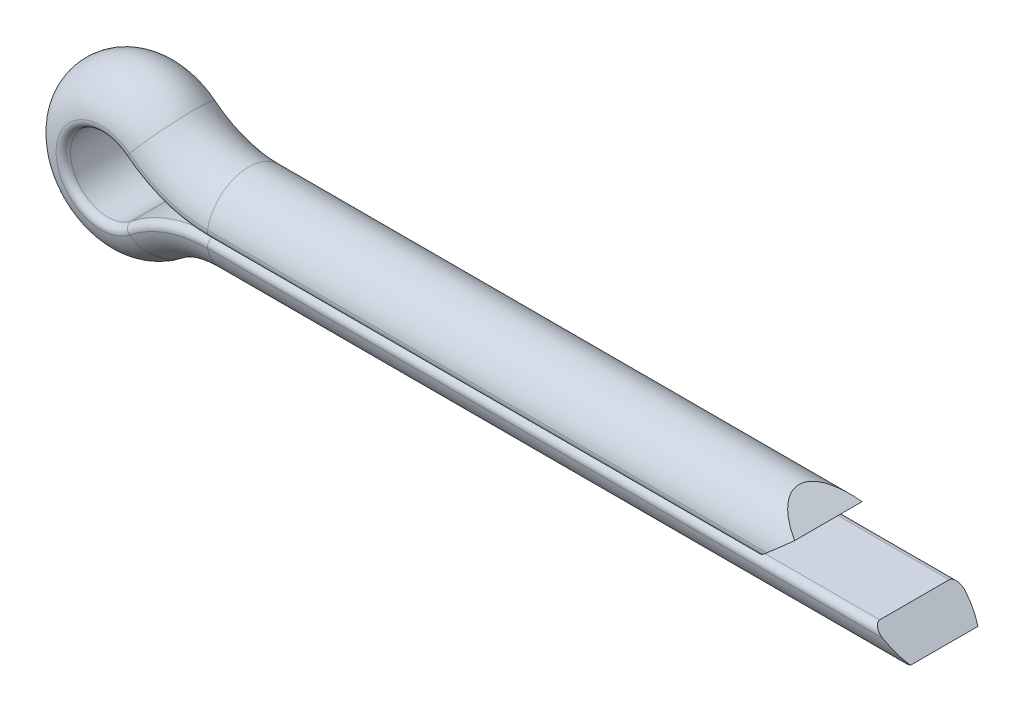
ISO-10303-21;
HEADER;
FILE_DESCRIPTION(('STEP AP214'),'2;1');
FILE_NAME('part.step','',(''),(''),'','','');
FILE_SCHEMA(('AUTOMOTIVE_DESIGN { 1 0 10303 214 1 1 1 1 }'));
ENDSEC;
DATA;
#1=APPLICATION_CONTEXT('core data for automotive mechanical design processes');
#2=APPLICATION_PROTOCOL_DEFINITION('international standard','automotive_design',2000,#1);
#3=PRODUCT_CONTEXT('',#1,'mechanical');
#4=PRODUCT('Part','Part','',(#3));
#5=PRODUCT_RELATED_PRODUCT_CATEGORY('part','',(#4));
#6=PRODUCT_DEFINITION_FORMATION('','',#4);
#7=PRODUCT_DEFINITION_CONTEXT('part definition',#1,'design');
#8=PRODUCT_DEFINITION('design','',#6,#7);
#9=PRODUCT_DEFINITION_SHAPE('','',#8);
#10=(LENGTH_UNIT() NAMED_UNIT(*) SI_UNIT(.MILLI.,.METRE.));
#11=(NAMED_UNIT(*) PLANE_ANGLE_UNIT() SI_UNIT($,.RADIAN.));
#12=(NAMED_UNIT(*) SI_UNIT($,.STERADIAN.) SOLID_ANGLE_UNIT());
#13=UNCERTAINTY_MEASURE_WITH_UNIT(LENGTH_MEASURE(1.E-05),#10,'distance_accuracy_value','');
#14=(GEOMETRIC_REPRESENTATION_CONTEXT(3) GLOBAL_UNCERTAINTY_ASSIGNED_CONTEXT((#13)) GLOBAL_UNIT_ASSIGNED_CONTEXT((#10,
#11,#12)) REPRESENTATION_CONTEXT('',''));
#15=CARTESIAN_POINT('',(0.,0.,0.));
#16=DIRECTION('',(0.,0.,1.));
#17=DIRECTION('',(1.,0.,0.));
#18=AXIS2_PLACEMENT_3D('',#15,#16,#17);
#19=CARTESIAN_POINT('',(3.66500000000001,0.,0.));
#20=DIRECTION('',(1.,0.,0.));
#21=DIRECTION('',(0.,0.,-1.));
#22=AXIS2_PLACEMENT_3D('',#19,#20,#21);
#23=CYLINDRICAL_SURFACE('',#22,1.45);
#24=CARTESIAN_POINT('',(29.1549658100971,0.,0.));
#25=DIRECTION('',(-0.501148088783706,0.865361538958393,0.));
#26=DIRECTION('',(0.865361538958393,0.501148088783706,0.));
#27=AXIS2_PLACEMENT_3D('',#24,#25,#26);
#28=ELLIPSE('',#27,2.89335634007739,1.45);
#29=CARTESIAN_POINT('',(27.665,-0.862868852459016,-1.16531426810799));
#30=VERTEX_POINT('',#29);
#31=CARTESIAN_POINT('',(27.665,-0.862868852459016,1.16531426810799));
#32=VERTEX_POINT('',#31);
#33=EDGE_CURVE('E166',#30,#32,#28,.T.);
#34=ORIENTED_EDGE('',*,*,#33,.T.);
#35=CARTESIAN_POINT('',(26.6338989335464,0.,0.));
#36=DIRECTION('',(-0.641771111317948,-0.766896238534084,0.));
#37=DIRECTION('',(0.766896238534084,-0.641771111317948,0.));
#38=AXIS2_PLACEMENT_3D('',#35,#36,#37);
#39=ELLIPSE('',#38,2.25937249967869,1.45);
#40=CARTESIAN_POINT('',(26.9633967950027,-0.275737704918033,1.42354090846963));
#41=VERTEX_POINT('',#40);
#42=EDGE_CURVE('E165',#32,#41,#39,.T.);
#43=ORIENTED_EDGE('',*,*,#42,.T.);
#44=DIRECTION('',(1.,0.,0.));
#45=VECTOR('',#44,1.);
#46=CARTESIAN_POINT('',(3.66500000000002,-0.275737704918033,1.42354090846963));
#47=LINE('',#46,#45);
#48=CARTESIAN_POINT('',(3.66500000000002,-0.275737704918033,1.42354090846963));
#49=VERTEX_POINT('',#48);
#50=EDGE_CURVE('E11',#49,#41,#47,.T.);
#51=ORIENTED_EDGE('',*,*,#50,.F.);
#52=CARTESIAN_POINT('',(3.66500000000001,0.,0.));
#53=DIRECTION('',(-1.,0.,0.));
#54=DIRECTION('',(0.,0.,-1.));
#55=AXIS2_PLACEMENT_3D('',#52,#53,#54);
#56=CIRCLE('',#55,1.45);
#57=CARTESIAN_POINT('',(3.66500000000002,-0.275737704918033,-1.42354090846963));
#58=VERTEX_POINT('',#57);
#59=EDGE_CURVE('E248',#58,#49,#56,.T.);
#60=ORIENTED_EDGE('',*,*,#59,.F.);
#61=DIRECTION('',(1.,0.,0.));
#62=VECTOR('',#61,1.);
#63=CARTESIAN_POINT('',(3.66500000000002,-0.275737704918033,-1.42354090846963));
#64=LINE('',#63,#62);
#65=CARTESIAN_POINT('',(26.9633967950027,-0.275737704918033,-1.42354090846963));
#66=VERTEX_POINT('',#65);
#67=EDGE_CURVE('E40',#58,#66,#64,.T.);
#68=ORIENTED_EDGE('',*,*,#67,.T.);
#69=EDGE_CURVE('E162',#66,#30,#39,.T.);
#70=ORIENTED_EDGE('',*,*,#69,.T.);
#71=EDGE_LOOP('',(#34,#43,#51,#60,#68,#70));
#72=FACE_BOUND('',#71,.T.);
#73=ADVANCED_FACE('F33',(#72),#23,.T.);
#74=CARTESIAN_POINT('',(3.66500000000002,-0.232000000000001,-1.19773786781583));
#75=DIRECTION('',(1.,0.,0.));
#76=DIRECTION('',(0.,0.,-1.));
#77=AXIS2_PLACEMENT_3D('',#74,#75,#76);
#78=CYLINDRICAL_SURFACE('',#77,0.23);
#79=CARTESIAN_POINT('',(26.9111316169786,-0.232000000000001,-1.19773786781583));
#80=DIRECTION('',(-0.641771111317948,-0.766896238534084,0.));
#81=DIRECTION('',(0.766896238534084,-0.641771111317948,0.));
#82=AXIS2_PLACEMENT_3D('',#79,#80,#81);
#83=ELLIPSE('',#82,0.358383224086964,0.23);
#84=CARTESIAN_POINT('',(26.6362888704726,-0.00200000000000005,-1.19773786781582));
#85=VERTEX_POINT('',#84);
#86=EDGE_CURVE('E160',#85,#66,#83,.T.);
#87=ORIENTED_EDGE('',*,*,#86,.T.);
#88=ORIENTED_EDGE('',*,*,#67,.F.);
#89=CARTESIAN_POINT('',(3.66500000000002,-0.232000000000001,-1.19773786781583));
#90=DIRECTION('',(-1.,0.,0.));
#91=DIRECTION('',(0.,0.,1.));
#92=AXIS2_PLACEMENT_3D('',#89,#90,#91);
#93=CIRCLE('',#92,0.23);
#94=CARTESIAN_POINT('',(3.66500000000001,-0.00200000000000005,-1.19773786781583));
#95=VERTEX_POINT('',#94);
#96=EDGE_CURVE('E245',#95,#58,#93,.T.);
#97=ORIENTED_EDGE('',*,*,#96,.F.);
#98=DIRECTION('',(1.,0.,0.));
#99=VECTOR('',#98,1.);
#100=CARTESIAN_POINT('',(3.66500000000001,-0.00200000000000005,-1.19773786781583));
#101=LINE('',#100,#99);
#102=EDGE_CURVE('E266',#95,#85,#101,.T.);
#103=ORIENTED_EDGE('',*,*,#102,.T.);
#104=EDGE_LOOP('',(#87,#88,#97,#103));
#105=FACE_BOUND('',#104,.T.);
#106=ADVANCED_FACE('F272',(#105),#78,.T.);
#107=CARTESIAN_POINT('',(3.66500000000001,-0.00200000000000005,1.19773786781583));
#108=DIRECTION('',(0.,-1.,0.));
#109=DIRECTION('',(0.,0.,-1.));
#110=AXIS2_PLACEMENT_3D('',#107,#108,#109);
#111=PLANE('',#110);
#112=DIRECTION('',(1.,0.,0.));
#113=VECTOR('',#112,1.);
#114=CARTESIAN_POINT('',(3.66500000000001,-0.00200000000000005,1.19773786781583));
#115=LINE('',#114,#113);
#116=CARTESIAN_POINT('',(3.66500000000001,-0.00200000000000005,1.19773786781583));
#117=VERTEX_POINT('',#116);
#118=CARTESIAN_POINT('',(26.6362888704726,-0.00200000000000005,1.19773786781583));
#119=VERTEX_POINT('',#118);
#120=EDGE_CURVE('E263',#117,#119,#115,.T.);
#121=ORIENTED_EDGE('',*,*,#120,.T.);
#122=DIRECTION('',(0.,0.,-1.));
#123=VECTOR('',#122,1.);
#124=CARTESIAN_POINT('',(26.6362888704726,-0.00200000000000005,1.19773786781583));
#125=LINE('',#124,#123);
#126=EDGE_CURVE('E154',#119,#85,#125,.T.);
#127=ORIENTED_EDGE('',*,*,#126,.T.);
#128=ORIENTED_EDGE('',*,*,#102,.F.);
#129=DIRECTION('',(0.,0.,-1.));
#130=VECTOR('',#129,1.);
#131=CARTESIAN_POINT('',(3.66500000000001,-0.00200000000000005,1.19773786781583));
#132=LINE('',#131,#130);
#133=EDGE_CURVE('E242',#117,#95,#132,.T.);
#134=ORIENTED_EDGE('',*,*,#133,.F.);
#135=EDGE_LOOP('',(#121,#127,#128,#134));
#136=FACE_BOUND('',#135,.T.);
#137=ADVANCED_FACE('F332',(#136),#111,.F.);
#138=CARTESIAN_POINT('',(3.66500000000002,-0.232000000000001,1.19773786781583));
#139=DIRECTION('',(1.,0.,0.));
#140=DIRECTION('',(0.,0.,-1.));
#141=AXIS2_PLACEMENT_3D('',#138,#139,#140);
#142=CYLINDRICAL_SURFACE('',#141,0.23);
#143=CARTESIAN_POINT('',(26.9111316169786,-0.232000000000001,1.19773786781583));
#144=DIRECTION('',(-0.641771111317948,-0.766896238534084,0.));
#145=DIRECTION('',(0.766896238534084,-0.641771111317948,0.));
#146=AXIS2_PLACEMENT_3D('',#143,#144,#145);
#147=ELLIPSE('',#146,0.358383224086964,0.23);
#148=EDGE_CURVE('E152',#41,#119,#147,.T.);
#149=ORIENTED_EDGE('',*,*,#148,.T.);
#150=ORIENTED_EDGE('',*,*,#120,.F.);
#151=CARTESIAN_POINT('',(3.66500000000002,-0.232000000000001,1.19773786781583));
#152=DIRECTION('',(-1.,0.,0.));
#153=DIRECTION('',(0.,0.,1.));
#154=AXIS2_PLACEMENT_3D('',#151,#152,#153);
#155=CIRCLE('',#154,0.23);
#156=EDGE_CURVE('E239',#49,#117,#155,.T.);
#157=ORIENTED_EDGE('',*,*,#156,.F.);
#158=ORIENTED_EDGE('',*,*,#50,.T.);
#159=EDGE_LOOP('',(#149,#150,#157,#158));
#160=FACE_BOUND('',#159,.T.);
#161=ADVANCED_FACE('F329',(#160),#142,.T.);
#162=CARTESIAN_POINT('',(3.665,-4.58404669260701,0.));
#163=DIRECTION('',(0.,0.,-1.));
#164=DIRECTION('',(-1.,0.,0.));
#165=AXIS2_PLACEMENT_3D('',#162,#163,#164);
#166=TOROIDAL_SURFACE('',#165,4.58404669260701,1.45);
#167=CARTESIAN_POINT('',(0.802434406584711,-1.00365533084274,0.));
#168=DIRECTION('',(-0.781054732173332,-0.624462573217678,0.));
#169=DIRECTION('',(0.,0.,-1.));
#170=AXIS2_PLACEMENT_3D('',#167,#168,#169);
#171=CIRCLE('',#170,1.45);
#172=CARTESIAN_POINT('',(0.974622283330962,-1.21902157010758,-1.42354090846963));
#173=VERTEX_POINT('',#172);
#174=CARTESIAN_POINT('',(0.974622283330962,-1.21902157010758,1.42354090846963));
#175=VERTEX_POINT('',#174);
#176=EDGE_CURVE('E224',#173,#175,#171,.T.);
#177=ORIENTED_EDGE('',*,*,#176,.F.);
#178=CARTESIAN_POINT('',(3.665,-4.58404669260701,-1.42354090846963));
#179=DIRECTION('',(0.,0.,-1.));
#180=DIRECTION('',(-1.,0.,0.));
#181=AXIS2_PLACEMENT_3D('',#178,#179,#180);
#182=CIRCLE('',#181,4.30830898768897);
#183=EDGE_CURVE('E257',#173,#58,#182,.T.);
#184=ORIENTED_EDGE('',*,*,#183,.T.);
#185=ORIENTED_EDGE('',*,*,#59,.T.);
#186=CARTESIAN_POINT('',(3.665,-4.58404669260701,1.42354090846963));
#187=DIRECTION('',(0.,0.,-1.));
#188=DIRECTION('',(-1.,0.,0.));
#189=AXIS2_PLACEMENT_3D('',#186,#187,#188);
#190=CIRCLE('',#189,4.30830898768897);
#191=EDGE_CURVE('E260',#175,#49,#190,.T.);
#192=ORIENTED_EDGE('',*,*,#191,.F.);
#193=EDGE_LOOP('',(#177,#184,#185,#192));
#194=FACE_BOUND('',#193,.T.);
#195=ADVANCED_FACE('F314',(#194),#166,.T.);
#196=CARTESIAN_POINT('',(3.665,-4.58404669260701,-1.19773786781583));
#197=DIRECTION('',(0.,0.,-1.));
#198=DIRECTION('',(-1.,0.,0.));
#199=AXIS2_PLACEMENT_3D('',#196,#197,#198);
#200=TOROIDAL_SURFACE('',#199,4.35204669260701,0.23);
#201=CARTESIAN_POINT('',(0.947309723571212,-1.18486002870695,-1.19773786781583));
#202=DIRECTION('',(-0.781054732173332,-0.624462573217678,0.));
#203=DIRECTION('',(0.,0.,1.));
#204=AXIS2_PLACEMENT_3D('',#201,#202,#203);
#205=CIRCLE('',#204,0.23);
#206=CARTESIAN_POINT('',(0.803683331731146,-1.00521744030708,-1.19773786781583));
#207=VERTEX_POINT('',#206);
#208=EDGE_CURVE('E221',#207,#173,#205,.T.);
#209=ORIENTED_EDGE('',*,*,#208,.F.);
#210=CARTESIAN_POINT('',(3.665,-4.58404669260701,-1.19773786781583));
#211=DIRECTION('',(0.,0.,-1.));
#212=DIRECTION('',(-1.,0.,0.));
#213=AXIS2_PLACEMENT_3D('',#210,#211,#212);
#214=CIRCLE('',#213,4.58204669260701);
#215=EDGE_CURVE('E254',#207,#95,#214,.T.);
#216=ORIENTED_EDGE('',*,*,#215,.T.);
#217=ORIENTED_EDGE('',*,*,#96,.T.);
#218=ORIENTED_EDGE('',*,*,#183,.F.);
#219=EDGE_LOOP('',(#209,#216,#217,#218));
#220=FACE_BOUND('',#219,.T.);
#221=ADVANCED_FACE('F320',(#220),#200,.T.);
#222=CARTESIAN_POINT('',(3.665,-4.58404669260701,0.));
#223=DIRECTION('',(0.,0.,-1.));
#224=DIRECTION('',(-1.,0.,0.));
#225=AXIS2_PLACEMENT_3D('',#222,#223,#224);
#226=CYLINDRICAL_SURFACE('',#225,4.58204669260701);
#227=DIRECTION('',(0.,0.,-1.));
#228=VECTOR('',#227,1.);
#229=CARTESIAN_POINT('',(0.803683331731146,-1.00521744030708,1.19773786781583));
#230=LINE('',#229,#228);
#231=CARTESIAN_POINT('',(0.803683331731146,-1.00521744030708,1.19773786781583));
#232=VERTEX_POINT('',#231);
#233=EDGE_CURVE('E218',#232,#207,#230,.T.);
#234=ORIENTED_EDGE('',*,*,#233,.F.);
#235=CARTESIAN_POINT('',(3.665,-4.58404669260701,1.19773786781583));
#236=DIRECTION('',(0.,0.,-1.));
#237=DIRECTION('',(-1.,0.,0.));
#238=AXIS2_PLACEMENT_3D('',#235,#236,#237);
#239=CIRCLE('',#238,4.58204669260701);
#240=EDGE_CURVE('E251',#232,#117,#239,.T.);
#241=ORIENTED_EDGE('',*,*,#240,.T.);
#242=ORIENTED_EDGE('',*,*,#133,.T.);
#243=ORIENTED_EDGE('',*,*,#215,.F.);
#244=EDGE_LOOP('',(#234,#241,#242,#243));
#245=FACE_BOUND('',#244,.T.);
#246=ADVANCED_FACE('F325',(#245),#226,.T.);
#247=CARTESIAN_POINT('',(3.665,-4.58404669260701,1.19773786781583));
#248=DIRECTION('',(0.,0.,-1.));
#249=DIRECTION('',(-1.,0.,0.));
#250=AXIS2_PLACEMENT_3D('',#247,#248,#249);
#251=TOROIDAL_SURFACE('',#250,4.35204669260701,0.23);
#252=CARTESIAN_POINT('',(0.947309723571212,-1.18486002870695,1.19773786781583));
#253=DIRECTION('',(-0.781054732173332,-0.624462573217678,0.));
#254=DIRECTION('',(0.,0.,1.));
#255=AXIS2_PLACEMENT_3D('',#252,#253,#254);
#256=CIRCLE('',#255,0.23);
#257=EDGE_CURVE('E215',#175,#232,#256,.T.);
#258=ORIENTED_EDGE('',*,*,#257,.F.);
#259=ORIENTED_EDGE('',*,*,#191,.T.);
#260=ORIENTED_EDGE('',*,*,#156,.T.);
#261=ORIENTED_EDGE('',*,*,#240,.F.);
#262=EDGE_LOOP('',(#258,#259,#260,#261));
#263=FACE_BOUND('',#262,.T.);
#264=ADVANCED_FACE('F327',(#263),#251,.T.);
#265=CARTESIAN_POINT('',(0.,0.,0.));
#266=DIRECTION('',(0.,0.,1.));
#267=DIRECTION('',(1.,0.,0.));
#268=AXIS2_PLACEMENT_3D('',#265,#266,#267);
#269=DEGENERATE_TOROIDAL_SURFACE('',#268,1.285,1.45,.T.);
#270=CARTESIAN_POINT('',(0.802434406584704,1.00365533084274,0.));
#271=DIRECTION('',(0.781054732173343,-0.624462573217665,0.));
#272=DIRECTION('',(0.,0.,-1.));
#273=AXIS2_PLACEMENT_3D('',#270,#271,#272);
#274=CIRCLE('',#273,1.45);
#275=CARTESIAN_POINT('',(0.974622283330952,1.21902157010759,-1.42354090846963));
#276=VERTEX_POINT('',#275);
#277=CARTESIAN_POINT('',(0.974622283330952,1.21902157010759,1.42354090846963));
#278=VERTEX_POINT('',#277);
#279=EDGE_CURVE('E200',#276,#278,#274,.T.);
#280=ORIENTED_EDGE('',*,*,#279,.F.);
#281=CARTESIAN_POINT('',(0.,0.,-1.42354090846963));
#282=DIRECTION('',(0.,0.,1.));
#283=DIRECTION('',(1.,0.,0.));
#284=AXIS2_PLACEMENT_3D('',#281,#282,#283);
#285=CIRCLE('',#284,1.56073770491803);
#286=EDGE_CURVE('E233',#276,#173,#285,.T.);
#287=ORIENTED_EDGE('',*,*,#286,.T.);
#288=ORIENTED_EDGE('',*,*,#176,.T.);
#289=CARTESIAN_POINT('',(0.,0.,1.42354090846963));
#290=DIRECTION('',(0.,0.,1.));
#291=DIRECTION('',(1.,0.,0.));
#292=AXIS2_PLACEMENT_3D('',#289,#290,#291);
#293=CIRCLE('',#292,1.56073770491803);
#294=EDGE_CURVE('E236',#278,#175,#293,.T.);
#295=ORIENTED_EDGE('',*,*,#294,.F.);
#296=EDGE_LOOP('',(#280,#287,#288,#295));
#297=FACE_BOUND('',#296,.T.);
#298=ADVANCED_FACE('F311',(#297),#269,.T.);
#299=CARTESIAN_POINT('',(0.,0.,-1.19773786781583));
#300=DIRECTION('',(0.,0.,1.));
#301=DIRECTION('',(1.,0.,0.));
#302=AXIS2_PLACEMENT_3D('',#299,#300,#301);
#303=TOROIDAL_SURFACE('',#302,1.517,0.23);
#304=CARTESIAN_POINT('',(0.947309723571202,1.18486002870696,-1.19773786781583));
#305=DIRECTION('',(0.781054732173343,-0.624462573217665,0.));
#306=DIRECTION('',(0.,0.,1.));
#307=AXIS2_PLACEMENT_3D('',#304,#305,#306);
#308=CIRCLE('',#307,0.23);
#309=CARTESIAN_POINT('',(0.803683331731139,1.00521744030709,-1.19773786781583));
#310=VERTEX_POINT('',#309);
#311=EDGE_CURVE('E197',#310,#276,#308,.T.);
#312=ORIENTED_EDGE('',*,*,#311,.F.);
#313=CARTESIAN_POINT('',(0.,0.,-1.19773786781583));
#314=DIRECTION('',(0.,0.,1.));
#315=DIRECTION('',(1.,0.,0.));
#316=AXIS2_PLACEMENT_3D('',#313,#314,#315);
#317=CIRCLE('',#316,1.287);
#318=EDGE_CURVE('E230',#310,#207,#317,.T.);
#319=ORIENTED_EDGE('',*,*,#318,.T.);
#320=ORIENTED_EDGE('',*,*,#208,.T.);
#321=ORIENTED_EDGE('',*,*,#286,.F.);
#322=EDGE_LOOP('',(#312,#319,#320,#321));
#323=FACE_BOUND('',#322,.T.);
#324=ADVANCED_FACE('F318',(#323),#303,.T.);
#325=CARTESIAN_POINT('',(0.,0.,0.));
#326=DIRECTION('',(0.,0.,1.));
#327=DIRECTION('',(1.,0.,0.));
#328=AXIS2_PLACEMENT_3D('',#325,#326,#327);
#329=CYLINDRICAL_SURFACE('',#328,1.287);
#330=DIRECTION('',(0.,0.,-1.));
#331=VECTOR('',#330,1.);
#332=CARTESIAN_POINT('',(0.803683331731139,1.00521744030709,1.19773786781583));
#333=LINE('',#332,#331);
#334=CARTESIAN_POINT('',(0.803683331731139,1.00521744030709,1.19773786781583));
#335=VERTEX_POINT('',#334);
#336=EDGE_CURVE('E194',#335,#310,#333,.T.);
#337=ORIENTED_EDGE('',*,*,#336,.F.);
#338=CARTESIAN_POINT('',(0.,0.,1.19773786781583));
#339=DIRECTION('',(0.,0.,1.));
#340=DIRECTION('',(1.,0.,0.));
#341=AXIS2_PLACEMENT_3D('',#338,#339,#340);
#342=CIRCLE('',#341,1.287);
#343=EDGE_CURVE('E227',#335,#232,#342,.T.);
#344=ORIENTED_EDGE('',*,*,#343,.T.);
#345=ORIENTED_EDGE('',*,*,#233,.T.);
#346=ORIENTED_EDGE('',*,*,#318,.F.);
#347=EDGE_LOOP('',(#337,#344,#345,#346));
#348=FACE_BOUND('',#347,.T.);
#349=ADVANCED_FACE('F323',(#348),#329,.F.);
#350=CARTESIAN_POINT('',(0.,0.,1.19773786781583));
#351=DIRECTION('',(0.,0.,1.));
#352=DIRECTION('',(1.,0.,0.));
#353=AXIS2_PLACEMENT_3D('',#350,#351,#352);
#354=TOROIDAL_SURFACE('',#353,1.517,0.23);
#355=CARTESIAN_POINT('',(0.947309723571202,1.18486002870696,1.19773786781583));
#356=DIRECTION('',(0.781054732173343,-0.624462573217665,0.));
#357=DIRECTION('',(0.,0.,1.));
#358=AXIS2_PLACEMENT_3D('',#355,#356,#357);
#359=CIRCLE('',#358,0.23);
#360=EDGE_CURVE('E184',#278,#335,#359,.T.);
#361=ORIENTED_EDGE('',*,*,#360,.F.);
#362=ORIENTED_EDGE('',*,*,#294,.T.);
#363=ORIENTED_EDGE('',*,*,#257,.T.);
#364=ORIENTED_EDGE('',*,*,#343,.F.);
#365=EDGE_LOOP('',(#361,#362,#363,#364));
#366=FACE_BOUND('',#365,.T.);
#367=ADVANCED_FACE('F308',(#366),#354,.T.);
#368=CARTESIAN_POINT('',(3.665,4.58404669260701,0.));
#369=DIRECTION('',(0.,0.,-1.));
#370=DIRECTION('',(-1.,0.,0.));
#371=AXIS2_PLACEMENT_3D('',#368,#369,#370);
#372=TOROIDAL_SURFACE('',#371,4.58404669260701,1.45);
#373=CARTESIAN_POINT('',(3.665,0.,0.));
#374=DIRECTION('',(1.,0.,0.));
#375=DIRECTION('',(0.,0.,-1.));
#376=AXIS2_PLACEMENT_3D('',#373,#374,#375);
#377=CIRCLE('',#376,1.45);
#378=CARTESIAN_POINT('',(3.665,0.275737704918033,-1.42354090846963));
#379=VERTEX_POINT('',#378);
#380=CARTESIAN_POINT('',(3.665,0.275737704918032,1.42354090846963));
#381=VERTEX_POINT('',#380);
#382=EDGE_CURVE('E178',#379,#381,#377,.T.);
#383=ORIENTED_EDGE('',*,*,#382,.F.);
#384=CARTESIAN_POINT('',(3.665,4.58404669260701,-1.42354090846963));
#385=DIRECTION('',(0.,0.,-1.));
#386=DIRECTION('',(-1.,0.,0.));
#387=AXIS2_PLACEMENT_3D('',#384,#385,#386);
#388=CIRCLE('',#387,4.30830898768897);
#389=EDGE_CURVE('E209',#379,#276,#388,.T.);
#390=ORIENTED_EDGE('',*,*,#389,.T.);
#391=ORIENTED_EDGE('',*,*,#279,.T.);
#392=CARTESIAN_POINT('',(3.665,4.58404669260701,1.42354090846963));
#393=DIRECTION('',(0.,0.,-1.));
#394=DIRECTION('',(-1.,0.,0.));
#395=AXIS2_PLACEMENT_3D('',#392,#393,#394);
#396=CIRCLE('',#395,4.30830898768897);
#397=EDGE_CURVE('E212',#381,#278,#396,.T.);
#398=ORIENTED_EDGE('',*,*,#397,.F.);
#399=EDGE_LOOP('',(#383,#390,#391,#398));
#400=FACE_BOUND('',#399,.T.);
#401=ADVANCED_FACE('F299',(#400),#372,.T.);
#402=CARTESIAN_POINT('',(3.665,4.58404669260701,-1.19773786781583));
#403=DIRECTION('',(0.,0.,-1.));
#404=DIRECTION('',(-1.,0.,0.));
#405=AXIS2_PLACEMENT_3D('',#402,#403,#404);
#406=TOROIDAL_SURFACE('',#405,4.35204669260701,0.23);
#407=CARTESIAN_POINT('',(3.665,0.232,-1.19773786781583));
#408=DIRECTION('',(1.,0.,0.));
#409=DIRECTION('',(0.,0.,1.));
#410=AXIS2_PLACEMENT_3D('',#407,#408,#409);
#411=CIRCLE('',#410,0.23);
#412=CARTESIAN_POINT('',(3.665,0.00200000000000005,-1.19773786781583));
#413=VERTEX_POINT('',#412);
#414=EDGE_CURVE('E175',#413,#379,#411,.T.);
#415=ORIENTED_EDGE('',*,*,#414,.F.);
#416=CARTESIAN_POINT('',(3.665,4.58404669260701,-1.19773786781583));
#417=DIRECTION('',(0.,0.,-1.));
#418=DIRECTION('',(-1.,0.,0.));
#419=AXIS2_PLACEMENT_3D('',#416,#417,#418);
#420=CIRCLE('',#419,4.58204669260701);
#421=EDGE_CURVE('E206',#413,#310,#420,.T.);
#422=ORIENTED_EDGE('',*,*,#421,.T.);
#423=ORIENTED_EDGE('',*,*,#311,.T.);
#424=ORIENTED_EDGE('',*,*,#389,.F.);
#425=EDGE_LOOP('',(#415,#422,#423,#424));
#426=FACE_BOUND('',#425,.T.);
#427=ADVANCED_FACE('F295',(#426),#406,.T.);
#428=CARTESIAN_POINT('',(3.665,4.58404669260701,0.));
#429=DIRECTION('',(0.,0.,-1.));
#430=DIRECTION('',(-1.,0.,0.));
#431=AXIS2_PLACEMENT_3D('',#428,#429,#430);
#432=CYLINDRICAL_SURFACE('',#431,4.58204669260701);
#433=DIRECTION('',(0.,0.,-1.));
#434=VECTOR('',#433,1.);
#435=CARTESIAN_POINT('',(3.665,0.00200000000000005,1.19773786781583));
#436=LINE('',#435,#434);
#437=CARTESIAN_POINT('',(3.665,0.00200000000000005,1.19773786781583));
#438=VERTEX_POINT('',#437);
#439=EDGE_CURVE('E172',#438,#413,#436,.T.);
#440=ORIENTED_EDGE('',*,*,#439,.F.);
#441=CARTESIAN_POINT('',(3.665,4.58404669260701,1.19773786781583));
#442=DIRECTION('',(0.,0.,-1.));
#443=DIRECTION('',(-1.,0.,0.));
#444=AXIS2_PLACEMENT_3D('',#441,#442,#443);
#445=CIRCLE('',#444,4.58204669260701);
#446=EDGE_CURVE('E203',#438,#335,#445,.T.);
#447=ORIENTED_EDGE('',*,*,#446,.T.);
#448=ORIENTED_EDGE('',*,*,#336,.T.);
#449=ORIENTED_EDGE('',*,*,#421,.F.);
#450=EDGE_LOOP('',(#440,#447,#448,#449));
#451=FACE_BOUND('',#450,.T.);
#452=ADVANCED_FACE('F291',(#451),#432,.T.);
#453=CARTESIAN_POINT('',(3.665,4.58404669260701,1.19773786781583));
#454=DIRECTION('',(0.,0.,-1.));
#455=DIRECTION('',(-1.,0.,0.));
#456=AXIS2_PLACEMENT_3D('',#453,#454,#455);
#457=TOROIDAL_SURFACE('',#456,4.35204669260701,0.23);
#458=CARTESIAN_POINT('',(3.665,0.232,1.19773786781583));
#459=DIRECTION('',(1.,0.,0.));
#460=DIRECTION('',(0.,0.,1.));
#461=AXIS2_PLACEMENT_3D('',#458,#459,#460);
#462=CIRCLE('',#461,0.23);
#463=EDGE_CURVE('E169',#381,#438,#462,.T.);
#464=ORIENTED_EDGE('',*,*,#463,.F.);
#465=ORIENTED_EDGE('',*,*,#397,.T.);
#466=ORIENTED_EDGE('',*,*,#360,.T.);
#467=ORIENTED_EDGE('',*,*,#446,.F.);
#468=EDGE_LOOP('',(#464,#465,#466,#467));
#469=FACE_BOUND('',#468,.T.);
#470=ADVANCED_FACE('F305',(#469),#457,.T.);
#471=CARTESIAN_POINT('',(3.665,0.232,1.19773786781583));
#472=DIRECTION('',(1.,0.,0.));
#473=DIRECTION('',(0.,0.,-1.));
#474=AXIS2_PLACEMENT_3D('',#471,#472,#473);
#475=CYLINDRICAL_SURFACE('',#474,0.23);
#476=DIRECTION('',(1.,0.,0.));
#477=VECTOR('',#476,1.);
#478=CARTESIAN_POINT('',(3.665,0.00200000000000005,1.19773786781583));
#479=LINE('',#478,#477);
#480=CARTESIAN_POINT('',(22.6362888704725,0.00200000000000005,1.19773786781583));
#481=VERTEX_POINT('',#480);
#482=EDGE_CURVE('E181',#438,#481,#479,.T.);
#483=ORIENTED_EDGE('',*,*,#482,.T.);
#484=CARTESIAN_POINT('',(22.9111316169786,0.232,1.19773786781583));
#485=DIRECTION('',(-0.641771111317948,0.766896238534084,0.));
#486=DIRECTION('',(0.766896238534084,0.641771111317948,0.));
#487=AXIS2_PLACEMENT_3D('',#484,#485,#486);
#488=ELLIPSE('',#487,0.358383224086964,0.23);
#489=CARTESIAN_POINT('',(22.9633967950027,0.275737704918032,1.42354090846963));
#490=VERTEX_POINT('',#489);
#491=EDGE_CURVE('E47',#490,#481,#488,.F.);
#492=ORIENTED_EDGE('',*,*,#491,.F.);
#493=DIRECTION('',(1.,0.,0.));
#494=VECTOR('',#493,1.);
#495=CARTESIAN_POINT('',(3.665,0.275737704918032,1.42354090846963));
#496=LINE('',#495,#494);
#497=EDGE_CURVE('E182',#381,#490,#496,.T.);
#498=ORIENTED_EDGE('',*,*,#497,.F.);
#499=ORIENTED_EDGE('',*,*,#463,.T.);
#500=EDGE_LOOP('',(#483,#492,#498,#499));
#501=FACE_BOUND('',#500,.T.);
#502=ADVANCED_FACE('F303',(#501),#475,.T.);
#503=CARTESIAN_POINT('',(3.665,0.,0.));
#504=DIRECTION('',(1.,0.,0.));
#505=DIRECTION('',(0.,0.,-1.));
#506=AXIS2_PLACEMENT_3D('',#503,#504,#505);
#507=CYLINDRICAL_SURFACE('',#506,1.45);
#508=CARTESIAN_POINT('',(22.6338989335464,0.,0.));
#509=DIRECTION('',(-0.641771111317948,0.766896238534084,0.));
#510=DIRECTION('',(0.766896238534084,0.641771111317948,0.));
#511=AXIS2_PLACEMENT_3D('',#508,#509,#510);
#512=ELLIPSE('',#511,2.25937249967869,1.45);
#513=CARTESIAN_POINT('',(23.665,0.862868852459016,1.16531426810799));
#514=VERTEX_POINT('',#513);
#515=EDGE_CURVE('E144',#514,#490,#512,.F.);
#516=ORIENTED_EDGE('',*,*,#515,.F.);
#517=CARTESIAN_POINT('',(25.154965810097,0.,0.));
#518=DIRECTION('',(-0.501148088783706,-0.865361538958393,0.));
#519=DIRECTION('',(0.865361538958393,-0.501148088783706,0.));
#520=AXIS2_PLACEMENT_3D('',#517,#518,#519);
#521=ELLIPSE('',#520,2.89335634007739,1.45);
#522=CARTESIAN_POINT('',(23.665,0.862868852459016,-1.16531426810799));
#523=VERTEX_POINT('',#522);
#524=EDGE_CURVE('E147',#523,#514,#521,.F.);
#525=ORIENTED_EDGE('',*,*,#524,.F.);
#526=CARTESIAN_POINT('',(22.9633967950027,0.275737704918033,-1.42354090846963));
#527=VERTEX_POINT('',#526);
#528=EDGE_CURVE('E132',#527,#523,#512,.F.);
#529=ORIENTED_EDGE('',*,*,#528,.F.);
#530=DIRECTION('',(1.,0.,0.));
#531=VECTOR('',#530,1.);
#532=CARTESIAN_POINT('',(3.665,0.275737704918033,-1.42354090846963));
#533=LINE('',#532,#531);
#534=EDGE_CURVE('E185',#379,#527,#533,.T.);
#535=ORIENTED_EDGE('',*,*,#534,.F.);
#536=ORIENTED_EDGE('',*,*,#382,.T.);
#537=ORIENTED_EDGE('',*,*,#497,.T.);
#538=EDGE_LOOP('',(#516,#525,#529,#535,#536,#537));
#539=FACE_BOUND('',#538,.T.);
#540=ADVANCED_FACE('F150',(#539),#507,.T.);
#541=CARTESIAN_POINT('',(3.665,0.232,-1.19773786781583));
#542=DIRECTION('',(1.,0.,0.));
#543=DIRECTION('',(0.,0.,-1.));
#544=AXIS2_PLACEMENT_3D('',#541,#542,#543);
#545=CYLINDRICAL_SURFACE('',#544,0.23);
#546=ORIENTED_EDGE('',*,*,#534,.T.);
#547=CARTESIAN_POINT('',(22.9111316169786,0.232,-1.19773786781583));
#548=DIRECTION('',(-0.641771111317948,0.766896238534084,0.));
#549=DIRECTION('',(0.766896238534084,0.641771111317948,0.));
#550=AXIS2_PLACEMENT_3D('',#547,#548,#549);
#551=ELLIPSE('',#550,0.358383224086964,0.23);
#552=CARTESIAN_POINT('',(22.6362888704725,0.00200000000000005,-1.19773786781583));
#553=VERTEX_POINT('',#552);
#554=EDGE_CURVE('E138',#553,#527,#551,.F.);
#555=ORIENTED_EDGE('',*,*,#554,.F.);
#556=DIRECTION('',(1.,0.,0.));
#557=VECTOR('',#556,1.);
#558=CARTESIAN_POINT('',(3.665,0.00200000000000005,-1.19773786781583));
#559=LINE('',#558,#557);
#560=EDGE_CURVE('E187',#413,#553,#559,.T.);
#561=ORIENTED_EDGE('',*,*,#560,.F.);
#562=ORIENTED_EDGE('',*,*,#414,.T.);
#563=EDGE_LOOP('',(#546,#555,#561,#562));
#564=FACE_BOUND('',#563,.T.);
#565=ADVANCED_FACE('F287',(#564),#545,.T.);
#566=CARTESIAN_POINT('',(3.665,0.00200000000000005,1.19773786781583));
#567=DIRECTION('',(0.,-1.,0.));
#568=DIRECTION('',(0.,0.,-1.));
#569=AXIS2_PLACEMENT_3D('',#566,#567,#568);
#570=PLANE('',#569);
#571=DIRECTION('',(0.,0.,-1.));
#572=VECTOR('',#571,1.);
#573=CARTESIAN_POINT('',(22.6362888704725,0.00200000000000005,1.19773786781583));
#574=LINE('',#573,#572);
#575=EDGE_CURVE('E279',#481,#553,#574,.T.);
#576=ORIENTED_EDGE('',*,*,#575,.F.);
#577=ORIENTED_EDGE('',*,*,#482,.F.);
#578=ORIENTED_EDGE('',*,*,#439,.T.);
#579=ORIENTED_EDGE('',*,*,#560,.T.);
#580=EDGE_LOOP('',(#576,#577,#578,#579));
#581=FACE_BOUND('',#580,.T.);
#582=ADVANCED_FACE('F288',(#581),#570,.T.);
#583=CARTESIAN_POINT('',(23.665,0.862868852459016,-1.42773786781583));
#584=DIRECTION('',(-0.641771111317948,0.766896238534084,0.));
#585=DIRECTION('',(-0.766896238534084,-0.641771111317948,0.));
#586=AXIS2_PLACEMENT_3D('',#583,#584,#585);
#587=PLANE('',#586);
#588=ORIENTED_EDGE('',*,*,#515,.T.);
#589=ORIENTED_EDGE('',*,*,#491,.T.);
#590=ORIENTED_EDGE('',*,*,#575,.T.);
#591=ORIENTED_EDGE('',*,*,#554,.T.);
#592=ORIENTED_EDGE('',*,*,#528,.T.);
#593=DIRECTION('',(0.,0.,1.));
#594=VECTOR('',#593,1.);
#595=CARTESIAN_POINT('',(23.665,0.862868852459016,-1.42773786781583));
#596=LINE('',#595,#594);
#597=EDGE_CURVE('E135',#523,#514,#596,.T.);
#598=ORIENTED_EDGE('',*,*,#597,.T.);
#599=EDGE_LOOP('',(#588,#589,#590,#591,#592,#598));
#600=FACE_BOUND('',#599,.T.);
#601=ADVANCED_FACE('F134',(#600),#587,.F.);
#602=CARTESIAN_POINT('',(22.6338989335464,1.46,-1.42773786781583));
#603=DIRECTION('',(-0.501148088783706,-0.865361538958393,0.));
#604=DIRECTION('',(0.865361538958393,-0.501148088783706,0.));
#605=AXIS2_PLACEMENT_3D('',#602,#603,#604);
#606=PLANE('',#605);
#607=ORIENTED_EDGE('',*,*,#524,.T.);
#608=ORIENTED_EDGE('',*,*,#597,.F.);
#609=EDGE_LOOP('',(#607,#608));
#610=FACE_BOUND('',#609,.T.);
#611=ADVANCED_FACE('F146',(#610),#606,.F.);
#612=CARTESIAN_POINT('',(27.665,-0.862868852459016,-1.42773786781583));
#613=DIRECTION('',(-0.501148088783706,0.865361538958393,0.));
#614=DIRECTION('',(-0.865361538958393,-0.501148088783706,0.));
#615=AXIS2_PLACEMENT_3D('',#612,#613,#614);
#616=PLANE('',#615);
#617=DIRECTION('',(0.,0.,1.));
#618=VECTOR('',#617,1.);
#619=CARTESIAN_POINT('',(27.665,-0.862868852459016,-1.42773786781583));
#620=LINE('',#619,#618);
#621=EDGE_CURVE('E148',#30,#32,#620,.T.);
#622=ORIENTED_EDGE('',*,*,#621,.T.);
#623=ORIENTED_EDGE('',*,*,#33,.F.);
#624=EDGE_LOOP('',(#622,#623));
#625=FACE_BOUND('',#624,.T.);
#626=ADVANCED_FACE('F333',(#625),#616,.F.);
#627=CARTESIAN_POINT('',(26.6338989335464,0.,-1.42773786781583));
#628=DIRECTION('',(-0.641771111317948,-0.766896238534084,0.));
#629=DIRECTION('',(0.766896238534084,-0.641771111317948,0.));
#630=AXIS2_PLACEMENT_3D('',#627,#628,#629);
#631=PLANE('',#630);
#632=ORIENTED_EDGE('',*,*,#621,.F.);
#633=ORIENTED_EDGE('',*,*,#69,.F.);
#634=ORIENTED_EDGE('',*,*,#86,.F.);
#635=ORIENTED_EDGE('',*,*,#126,.F.);
#636=ORIENTED_EDGE('',*,*,#148,.F.);
#637=ORIENTED_EDGE('',*,*,#42,.F.);
#638=EDGE_LOOP('',(#632,#633,#634,#635,#636,#637));
#639=FACE_BOUND('',#638,.T.);
#640=ADVANCED_FACE('F276',(#639),#631,.F.);
#641=CLOSED_SHELL('',(#73,#106,#137,#161,#195,#221,#246,#264,#298,#324,#349,#367,#401,#427,#452,
#470,#502,#540,#565,#582,#601,#611,#626,#640));
#642=MANIFOLD_SOLID_BREP('B2',#641);
#643=ADVANCED_BREP_SHAPE_REPRESENTATION('',(#18,#642),#14);
#644=SHAPE_DEFINITION_REPRESENTATION(#9,#643);
ENDSEC;
END-ISO-10303-21;
